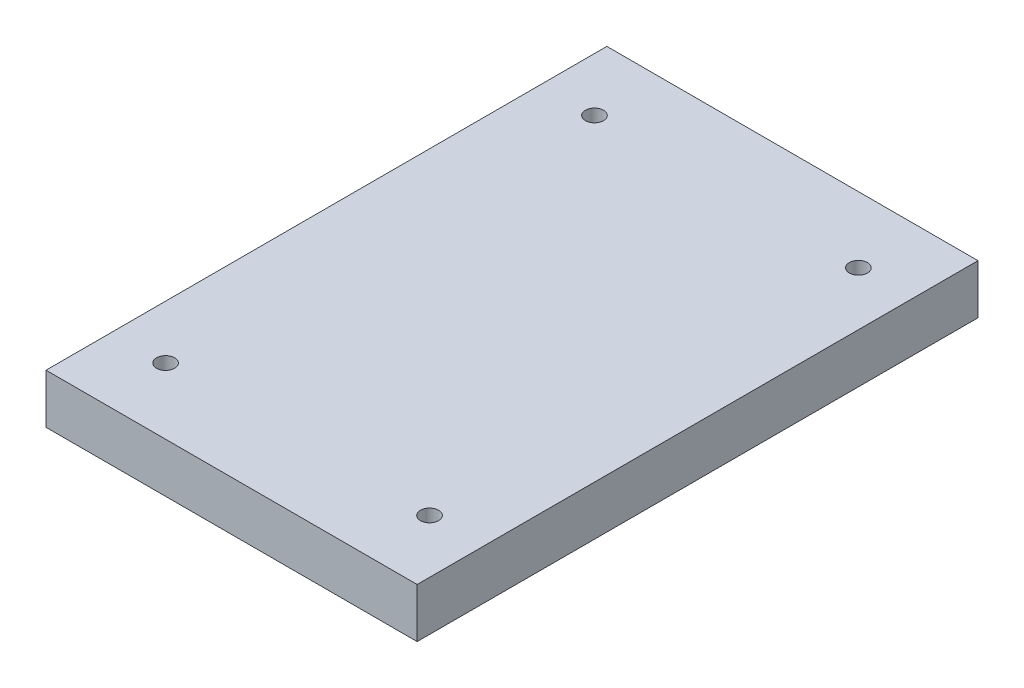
ISO-10303-21;
HEADER;
FILE_DESCRIPTION(('STEP AP214'),'2;1');
FILE_NAME('part.step','',(''),(''),'','','');
FILE_SCHEMA(('AUTOMOTIVE_DESIGN { 1 0 10303 214 1 1 1 1 }'));
ENDSEC;
DATA;
#1=APPLICATION_CONTEXT('core data for automotive mechanical design processes');
#2=APPLICATION_PROTOCOL_DEFINITION('international standard','automotive_design',2000,#1);
#3=PRODUCT_CONTEXT('',#1,'mechanical');
#4=PRODUCT('Part','Part','',(#3));
#5=PRODUCT_RELATED_PRODUCT_CATEGORY('part','',(#4));
#6=PRODUCT_DEFINITION_FORMATION('','',#4);
#7=PRODUCT_DEFINITION_CONTEXT('part definition',#1,'design');
#8=PRODUCT_DEFINITION('design','',#6,#7);
#9=PRODUCT_DEFINITION_SHAPE('','',#8);
#10=(LENGTH_UNIT() NAMED_UNIT(*) SI_UNIT(.MILLI.,.METRE.));
#11=(NAMED_UNIT(*) PLANE_ANGLE_UNIT() SI_UNIT($,.RADIAN.));
#12=(NAMED_UNIT(*) SI_UNIT($,.STERADIAN.) SOLID_ANGLE_UNIT());
#13=UNCERTAINTY_MEASURE_WITH_UNIT(LENGTH_MEASURE(1.E-05),#10,'distance_accuracy_value','');
#14=(GEOMETRIC_REPRESENTATION_CONTEXT(3) GLOBAL_UNCERTAINTY_ASSIGNED_CONTEXT((#13)) GLOBAL_UNIT_ASSIGNED_CONTEXT((#10,
#11,#12)) REPRESENTATION_CONTEXT('',''));
#15=CARTESIAN_POINT('',(0.,0.,0.));
#16=DIRECTION('',(0.,0.,1.));
#17=DIRECTION('',(1.,0.,0.));
#18=AXIS2_PLACEMENT_3D('',#15,#16,#17);
#19=CARTESIAN_POINT('',(0.,6.,0.));
#20=DIRECTION('',(0.,1.,0.));
#21=DIRECTION('',(0.,0.,1.));
#22=AXIS2_PLACEMENT_3D('',#19,#20,#21);
#23=PLANE('',#22);
#24=CARTESIAN_POINT('',(36.,6.,-11.));
#25=DIRECTION('',(0.,1.,0.));
#26=DIRECTION('',(0.,0.,1.));
#27=AXIS2_PLACEMENT_3D('',#24,#25,#26);
#28=CIRCLE('',#27,1.10000000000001);
#29=CARTESIAN_POINT('',(36.,6.,-9.89999999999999));
#30=VERTEX_POINT('',#29);
#31=EDGE_CURVE('E121',#30,#30,#28,.T.);
#32=ORIENTED_EDGE('',*,*,#31,.F.);
#33=EDGE_LOOP('',(#32));
#34=FACE_BOUND('',#33,.T.);
#35=CARTESIAN_POINT('',(4.,6.,-63.));
#36=DIRECTION('',(0.,1.,0.));
#37=DIRECTION('',(0.,0.,1.));
#38=AXIS2_PLACEMENT_3D('',#35,#36,#37);
#39=CIRCLE('',#38,1.1);
#40=CARTESIAN_POINT('',(4.,6.,-61.9));
#41=VERTEX_POINT('',#40);
#42=EDGE_CURVE('E100',#41,#41,#39,.T.);
#43=ORIENTED_EDGE('',*,*,#42,.F.);
#44=EDGE_LOOP('',(#43));
#45=FACE_BOUND('',#44,.T.);
#46=DIRECTION('',(0.,0.,-1.));
#47=VECTOR('',#46,1.);
#48=CARTESIAN_POINT('',(42.5,6.,-71.));
#49=LINE('',#48,#47);
#50=CARTESIAN_POINT('',(42.5,6.,-3.));
#51=VERTEX_POINT('',#50);
#52=CARTESIAN_POINT('',(42.5,6.,-71.));
#53=VERTEX_POINT('',#52);
#54=EDGE_CURVE('E85',#51,#53,#49,.T.);
#55=ORIENTED_EDGE('',*,*,#54,.T.);
#56=DIRECTION('',(-1.,0.,0.));
#57=VECTOR('',#56,1.);
#58=CARTESIAN_POINT('',(-2.5,6.,-71.));
#59=LINE('',#58,#57);
#60=CARTESIAN_POINT('',(-2.5,6.,-71.));
#61=VERTEX_POINT('',#60);
#62=EDGE_CURVE('E80',#53,#61,#59,.T.);
#63=ORIENTED_EDGE('',*,*,#62,.T.);
#64=DIRECTION('',(0.,0.,1.));
#65=VECTOR('',#64,1.);
#66=CARTESIAN_POINT('',(-2.5,6.,-71.));
#67=LINE('',#66,#65);
#68=CARTESIAN_POINT('',(-2.5,6.,-3.));
#69=VERTEX_POINT('',#68);
#70=EDGE_CURVE('E83',#61,#69,#67,.T.);
#71=ORIENTED_EDGE('',*,*,#70,.T.);
#72=DIRECTION('',(1.,0.,0.));
#73=VECTOR('',#72,1.);
#74=CARTESIAN_POINT('',(-2.5,6.,-3.));
#75=LINE('',#74,#73);
#76=EDGE_CURVE('E50',#69,#51,#75,.T.);
#77=ORIENTED_EDGE('',*,*,#76,.T.);
#78=EDGE_LOOP('',(#55,#63,#71,#77));
#79=FACE_BOUND('',#78,.T.);
#80=CARTESIAN_POINT('',(36.,6.,-63.));
#81=DIRECTION('',(0.,1.,0.));
#82=DIRECTION('',(0.,0.,-1.));
#83=AXIS2_PLACEMENT_3D('',#80,#81,#82);
#84=CIRCLE('',#83,1.10000000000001);
#85=CARTESIAN_POINT('',(36.,6.,-64.1));
#86=VERTEX_POINT('',#85);
#87=EDGE_CURVE('E115',#86,#86,#84,.T.);
#88=ORIENTED_EDGE('',*,*,#87,.F.);
#89=EDGE_LOOP('',(#88));
#90=FACE_BOUND('',#89,.T.);
#91=CARTESIAN_POINT('',(4.,6.,-11.));
#92=DIRECTION('',(0.,1.,0.));
#93=DIRECTION('',(0.,0.,-1.));
#94=AXIS2_PLACEMENT_3D('',#91,#92,#93);
#95=CIRCLE('',#94,1.1);
#96=CARTESIAN_POINT('',(4.,6.,-12.1));
#97=VERTEX_POINT('',#96);
#98=EDGE_CURVE('E127',#97,#97,#95,.T.);
#99=ORIENTED_EDGE('',*,*,#98,.F.);
#100=EDGE_LOOP('',(#99));
#101=FACE_BOUND('',#100,.T.);
#102=ADVANCED_FACE('F33',(#34,#45,#79,#90,#101),#23,.T.);
#103=CARTESIAN_POINT('',(0.,0.,0.));
#104=DIRECTION('',(0.,1.,0.));
#105=DIRECTION('',(0.,0.,1.));
#106=AXIS2_PLACEMENT_3D('',#103,#104,#105);
#107=PLANE('',#106);
#108=DIRECTION('',(0.,0.,-1.));
#109=VECTOR('',#108,1.);
#110=CARTESIAN_POINT('',(42.5,0.,-71.));
#111=LINE('',#110,#109);
#112=CARTESIAN_POINT('',(42.5,0.,-3.));
#113=VERTEX_POINT('',#112);
#114=CARTESIAN_POINT('',(42.5,0.,-71.));
#115=VERTEX_POINT('',#114);
#116=EDGE_CURVE('E97',#113,#115,#111,.T.);
#117=ORIENTED_EDGE('',*,*,#116,.F.);
#118=DIRECTION('',(1.,0.,0.));
#119=VECTOR('',#118,1.);
#120=CARTESIAN_POINT('',(-2.5,0.,-3.));
#121=LINE('',#120,#119);
#122=CARTESIAN_POINT('',(-2.5,0.,-3.));
#123=VERTEX_POINT('',#122);
#124=EDGE_CURVE('E73',#123,#113,#121,.T.);
#125=ORIENTED_EDGE('',*,*,#124,.F.);
#126=DIRECTION('',(0.,0.,1.));
#127=VECTOR('',#126,1.);
#128=CARTESIAN_POINT('',(-2.5,0.,-71.));
#129=LINE('',#128,#127);
#130=CARTESIAN_POINT('',(-2.5,0.,-71.));
#131=VERTEX_POINT('',#130);
#132=EDGE_CURVE('E67',#131,#123,#129,.T.);
#133=ORIENTED_EDGE('',*,*,#132,.F.);
#134=DIRECTION('',(-1.,0.,0.));
#135=VECTOR('',#134,1.);
#136=CARTESIAN_POINT('',(-2.5,0.,-71.));
#137=LINE('',#136,#135);
#138=EDGE_CURVE('E89',#115,#131,#137,.T.);
#139=ORIENTED_EDGE('',*,*,#138,.F.);
#140=EDGE_LOOP('',(#117,#125,#133,#139));
#141=FACE_BOUND('',#140,.T.);
#142=CARTESIAN_POINT('',(4.,0.,-63.));
#143=DIRECTION('',(0.,1.,0.));
#144=DIRECTION('',(0.,0.,1.));
#145=AXIS2_PLACEMENT_3D('',#142,#143,#144);
#146=CIRCLE('',#145,1.1);
#147=CARTESIAN_POINT('',(4.,0.,-61.9));
#148=VERTEX_POINT('',#147);
#149=EDGE_CURVE('E112',#148,#148,#146,.T.);
#150=ORIENTED_EDGE('',*,*,#149,.T.);
#151=EDGE_LOOP('',(#150));
#152=FACE_BOUND('',#151,.T.);
#153=CARTESIAN_POINT('',(36.,0.,-63.));
#154=DIRECTION('',(0.,1.,0.));
#155=DIRECTION('',(0.,0.,-1.));
#156=AXIS2_PLACEMENT_3D('',#153,#154,#155);
#157=CIRCLE('',#156,1.10000000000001);
#158=CARTESIAN_POINT('',(36.,0.,-64.1));
#159=VERTEX_POINT('',#158);
#160=EDGE_CURVE('E118',#159,#159,#157,.T.);
#161=ORIENTED_EDGE('',*,*,#160,.T.);
#162=EDGE_LOOP('',(#161));
#163=FACE_BOUND('',#162,.T.);
#164=CARTESIAN_POINT('',(36.,0.,-11.));
#165=DIRECTION('',(0.,1.,0.));
#166=DIRECTION('',(0.,0.,1.));
#167=AXIS2_PLACEMENT_3D('',#164,#165,#166);
#168=CIRCLE('',#167,1.10000000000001);
#169=CARTESIAN_POINT('',(36.,0.,-9.89999999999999));
#170=VERTEX_POINT('',#169);
#171=EDGE_CURVE('E124',#170,#170,#168,.T.);
#172=ORIENTED_EDGE('',*,*,#171,.T.);
#173=EDGE_LOOP('',(#172));
#174=FACE_BOUND('',#173,.T.);
#175=CARTESIAN_POINT('',(4.,0.,-11.));
#176=DIRECTION('',(0.,1.,0.));
#177=DIRECTION('',(0.,0.,-1.));
#178=AXIS2_PLACEMENT_3D('',#175,#176,#177);
#179=CIRCLE('',#178,1.1);
#180=CARTESIAN_POINT('',(4.,0.,-12.1));
#181=VERTEX_POINT('',#180);
#182=EDGE_CURVE('E130',#181,#181,#179,.T.);
#183=ORIENTED_EDGE('',*,*,#182,.T.);
#184=EDGE_LOOP('',(#183));
#185=FACE_BOUND('',#184,.T.);
#186=ADVANCED_FACE('F108',(#141,#152,#163,#174,#185),#107,.F.);
#187=CARTESIAN_POINT('',(42.5,6.,-71.));
#188=DIRECTION('',(-1.,0.,0.));
#189=DIRECTION('',(0.,0.,1.));
#190=AXIS2_PLACEMENT_3D('',#187,#188,#189);
#191=PLANE('',#190);
#192=ORIENTED_EDGE('',*,*,#116,.T.);
#193=DIRECTION('',(0.,-1.,0.));
#194=VECTOR('',#193,1.);
#195=CARTESIAN_POINT('',(42.5,6.,-71.));
#196=LINE('',#195,#194);
#197=EDGE_CURVE('E11',#53,#115,#196,.T.);
#198=ORIENTED_EDGE('',*,*,#197,.F.);
#199=ORIENTED_EDGE('',*,*,#54,.F.);
#200=DIRECTION('',(0.,-1.,0.));
#201=VECTOR('',#200,1.);
#202=CARTESIAN_POINT('',(42.5,6.,-3.));
#203=LINE('',#202,#201);
#204=EDGE_CURVE('E93',#51,#113,#203,.T.);
#205=ORIENTED_EDGE('',*,*,#204,.T.);
#206=EDGE_LOOP('',(#192,#198,#199,#205));
#207=FACE_BOUND('',#206,.T.);
#208=ADVANCED_FACE('F35',(#207),#191,.F.);
#209=CARTESIAN_POINT('',(-2.5,6.,-71.));
#210=DIRECTION('',(0.,0.,1.));
#211=DIRECTION('',(1.,0.,0.));
#212=AXIS2_PLACEMENT_3D('',#209,#210,#211);
#213=PLANE('',#212);
#214=ORIENTED_EDGE('',*,*,#138,.T.);
#215=DIRECTION('',(0.,-1.,0.));
#216=VECTOR('',#215,1.);
#217=CARTESIAN_POINT('',(-2.5,6.,-71.));
#218=LINE('',#217,#216);
#219=EDGE_CURVE('E42',#61,#131,#218,.T.);
#220=ORIENTED_EDGE('',*,*,#219,.F.);
#221=ORIENTED_EDGE('',*,*,#62,.F.);
#222=ORIENTED_EDGE('',*,*,#197,.T.);
#223=EDGE_LOOP('',(#214,#220,#221,#222));
#224=FACE_BOUND('',#223,.T.);
#225=ADVANCED_FACE('F88',(#224),#213,.F.);
#226=CARTESIAN_POINT('',(-2.5,6.,-71.));
#227=DIRECTION('',(1.,0.,0.));
#228=DIRECTION('',(0.,0.,-1.));
#229=AXIS2_PLACEMENT_3D('',#226,#227,#228);
#230=PLANE('',#229);
#231=ORIENTED_EDGE('',*,*,#132,.T.);
#232=DIRECTION('',(0.,-1.,0.));
#233=VECTOR('',#232,1.);
#234=CARTESIAN_POINT('',(-2.5,6.,-3.));
#235=LINE('',#234,#233);
#236=EDGE_CURVE('E90',#69,#123,#235,.T.);
#237=ORIENTED_EDGE('',*,*,#236,.F.);
#238=ORIENTED_EDGE('',*,*,#70,.F.);
#239=ORIENTED_EDGE('',*,*,#219,.T.);
#240=EDGE_LOOP('',(#231,#237,#238,#239));
#241=FACE_BOUND('',#240,.T.);
#242=ADVANCED_FACE('F91',(#241),#230,.F.);
#243=CARTESIAN_POINT('',(-2.5,6.,-3.));
#244=DIRECTION('',(0.,0.,-1.));
#245=DIRECTION('',(-1.,0.,0.));
#246=AXIS2_PLACEMENT_3D('',#243,#244,#245);
#247=PLANE('',#246);
#248=ORIENTED_EDGE('',*,*,#124,.T.);
#249=ORIENTED_EDGE('',*,*,#204,.F.);
#250=ORIENTED_EDGE('',*,*,#76,.F.);
#251=ORIENTED_EDGE('',*,*,#236,.T.);
#252=EDGE_LOOP('',(#248,#249,#250,#251));
#253=FACE_BOUND('',#252,.T.);
#254=ADVANCED_FACE('F105',(#253),#247,.F.);
#255=CARTESIAN_POINT('',(4.,6.,-63.));
#256=DIRECTION('',(0.,-1.,0.));
#257=DIRECTION('',(0.,0.,-1.));
#258=AXIS2_PLACEMENT_3D('',#255,#256,#257);
#259=CYLINDRICAL_SURFACE('',#258,1.1);
#260=ORIENTED_EDGE('',*,*,#42,.T.);
#261=EDGE_LOOP('',(#260));
#262=FACE_BOUND('',#261,.T.);
#263=ORIENTED_EDGE('',*,*,#149,.F.);
#264=EDGE_LOOP('',(#263));
#265=FACE_BOUND('',#264,.T.);
#266=ADVANCED_FACE('F149',(#262,#265),#259,.F.);
#267=CARTESIAN_POINT('',(36.,6.,-63.));
#268=DIRECTION('',(0.,-1.,0.));
#269=DIRECTION('',(0.,0.,-1.));
#270=AXIS2_PLACEMENT_3D('',#267,#268,#269);
#271=CYLINDRICAL_SURFACE('',#270,1.10000000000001);
#272=ORIENTED_EDGE('',*,*,#87,.T.);
#273=EDGE_LOOP('',(#272));
#274=FACE_BOUND('',#273,.T.);
#275=ORIENTED_EDGE('',*,*,#160,.F.);
#276=EDGE_LOOP('',(#275));
#277=FACE_BOUND('',#276,.T.);
#278=ADVANCED_FACE('F195',(#274,#277),#271,.F.);
#279=CARTESIAN_POINT('',(36.,6.,-11.));
#280=DIRECTION('',(0.,-1.,0.));
#281=DIRECTION('',(0.,0.,-1.));
#282=AXIS2_PLACEMENT_3D('',#279,#280,#281);
#283=CYLINDRICAL_SURFACE('',#282,1.10000000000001);
#284=ORIENTED_EDGE('',*,*,#31,.T.);
#285=EDGE_LOOP('',(#284));
#286=FACE_BOUND('',#285,.T.);
#287=ORIENTED_EDGE('',*,*,#171,.F.);
#288=EDGE_LOOP('',(#287));
#289=FACE_BOUND('',#288,.T.);
#290=ADVANCED_FACE('F203',(#286,#289),#283,.F.);
#291=CARTESIAN_POINT('',(4.,6.,-11.));
#292=DIRECTION('',(0.,-1.,0.));
#293=DIRECTION('',(0.,0.,-1.));
#294=AXIS2_PLACEMENT_3D('',#291,#292,#293);
#295=CYLINDRICAL_SURFACE('',#294,1.1);
#296=ORIENTED_EDGE('',*,*,#98,.T.);
#297=EDGE_LOOP('',(#296));
#298=FACE_BOUND('',#297,.T.);
#299=ORIENTED_EDGE('',*,*,#182,.F.);
#300=EDGE_LOOP('',(#299));
#301=FACE_BOUND('',#300,.T.);
#302=ADVANCED_FACE('F136',(#298,#301),#295,.F.);
#303=CLOSED_SHELL('',(#102,#186,#208,#225,#242,#254,#266,#278,#290,#302));
#304=MANIFOLD_SOLID_BREP('B2',#303);
#305=ADVANCED_BREP_SHAPE_REPRESENTATION('',(#18,#304),#14);
#306=SHAPE_DEFINITION_REPRESENTATION(#9,#305);
ENDSEC;
END-ISO-10303-21;
